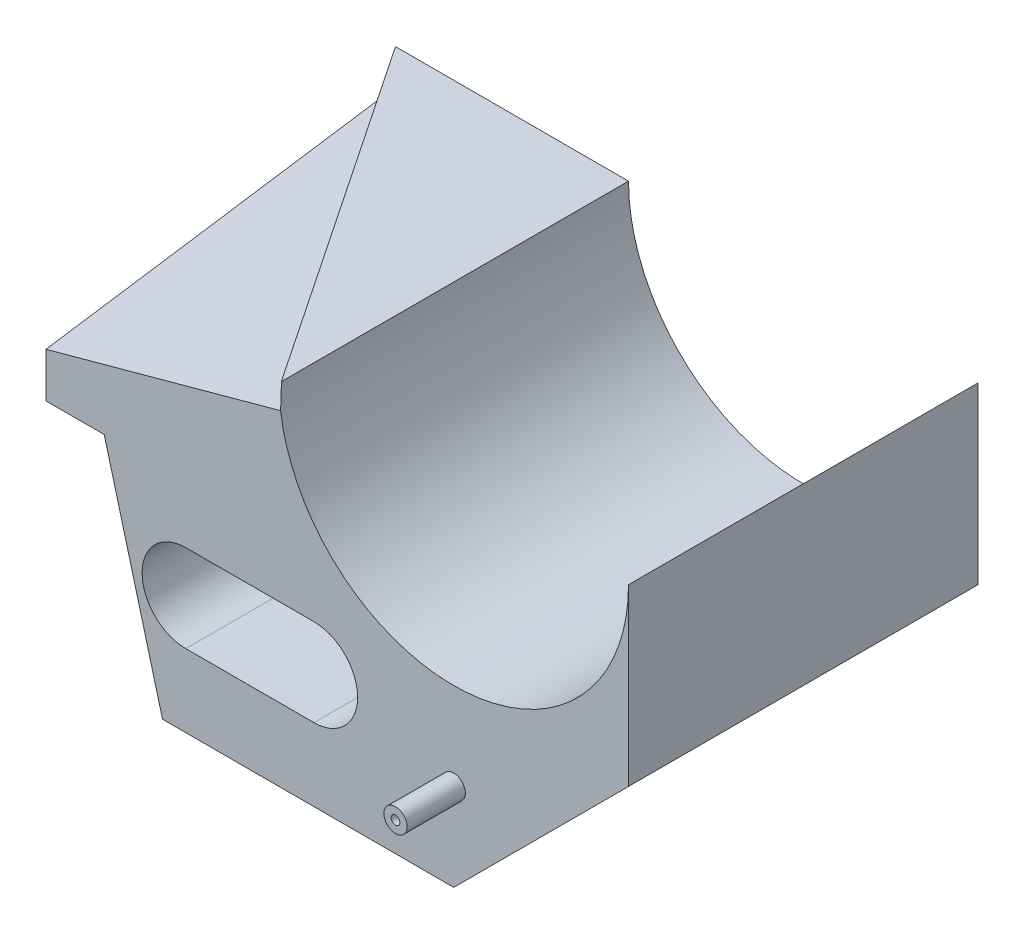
ISO-10303-21;
HEADER;
FILE_DESCRIPTION(('STEP AP214'),'2;1');
FILE_NAME('part.step','',(''),(''),'','','');
FILE_SCHEMA(('AUTOMOTIVE_DESIGN { 1 0 10303 214 1 1 1 1 }'));
ENDSEC;
DATA;
#1=APPLICATION_CONTEXT('core data for automotive mechanical design processes');
#2=APPLICATION_PROTOCOL_DEFINITION('international standard','automotive_design',2000,#1);
#3=PRODUCT_CONTEXT('',#1,'mechanical');
#4=PRODUCT('Part','Part','',(#3));
#5=PRODUCT_RELATED_PRODUCT_CATEGORY('part','',(#4));
#6=PRODUCT_DEFINITION_FORMATION('','',#4);
#7=PRODUCT_DEFINITION_CONTEXT('part definition',#1,'design');
#8=PRODUCT_DEFINITION('design','',#6,#7);
#9=PRODUCT_DEFINITION_SHAPE('','',#8);
#10=(LENGTH_UNIT() NAMED_UNIT(*) SI_UNIT(.MILLI.,.METRE.));
#11=(NAMED_UNIT(*) PLANE_ANGLE_UNIT() SI_UNIT($,.RADIAN.));
#12=(NAMED_UNIT(*) SI_UNIT($,.STERADIAN.) SOLID_ANGLE_UNIT());
#13=UNCERTAINTY_MEASURE_WITH_UNIT(LENGTH_MEASURE(1.E-05),#10,'distance_accuracy_value','');
#14=(GEOMETRIC_REPRESENTATION_CONTEXT(3) GLOBAL_UNCERTAINTY_ASSIGNED_CONTEXT((#13)) GLOBAL_UNIT_ASSIGNED_CONTEXT((#10,
#11,#12)) REPRESENTATION_CONTEXT('',''));
#15=CARTESIAN_POINT('',(0.,0.,0.));
#16=DIRECTION('',(0.,0.,1.));
#17=DIRECTION('',(1.,0.,0.));
#18=AXIS2_PLACEMENT_3D('',#15,#16,#17);
#19=CARTESIAN_POINT('',(-10.,37.3205080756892,30.));
#20=DIRECTION('',(0.965925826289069,0.258819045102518,0.));
#21=DIRECTION('',(-0.258819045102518,0.965925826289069,0.));
#22=AXIS2_PLACEMENT_3D('',#19,#20,#21);
#23=PLANE('',#22);
#24=DIRECTION('',(0.258819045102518,-0.965925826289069,0.));
#25=VECTOR('',#24,1.);
#26=CARTESIAN_POINT('',(-10.,37.3205080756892,-30.));
#27=LINE('',#26,#25);
#28=CARTESIAN_POINT('',(-10.,37.3205080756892,-30.));
#29=VERTEX_POINT('',#28);
#30=CARTESIAN_POINT('',(0.,0.,-30.));
#31=VERTEX_POINT('',#30);
#32=EDGE_CURVE('E171',#29,#31,#27,.T.);
#33=ORIENTED_EDGE('',*,*,#32,.T.);
#34=DIRECTION('',(0.,0.,-1.));
#35=VECTOR('',#34,1.);
#36=CARTESIAN_POINT('',(0.,0.,30.));
#37=LINE('',#36,#35);
#38=CARTESIAN_POINT('',(0.,0.,30.));
#39=VERTEX_POINT('',#38);
#40=EDGE_CURVE('E54',#39,#31,#37,.T.);
#41=ORIENTED_EDGE('',*,*,#40,.F.);
#42=DIRECTION('',(0.258819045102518,-0.965925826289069,0.));
#43=VECTOR('',#42,1.);
#44=CARTESIAN_POINT('',(-10.,37.3205080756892,30.));
#45=LINE('',#44,#43);
#46=CARTESIAN_POINT('',(-10.,37.3205080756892,30.));
#47=VERTEX_POINT('',#46);
#48=EDGE_CURVE('E214',#47,#39,#45,.T.);
#49=ORIENTED_EDGE('',*,*,#48,.F.);
#50=DIRECTION('',(0.,0.,-1.));
#51=VECTOR('',#50,1.);
#52=CARTESIAN_POINT('',(-10.,37.3205080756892,30.));
#53=LINE('',#52,#51);
#54=EDGE_CURVE('E170',#47,#29,#53,.T.);
#55=ORIENTED_EDGE('',*,*,#54,.T.);
#56=EDGE_LOOP('',(#33,#41,#49,#55));
#57=FACE_BOUND('',#56,.T.);
#58=ADVANCED_FACE('F46',(#57),#23,.F.);
#59=CARTESIAN_POINT('',(0.,0.,30.));
#60=DIRECTION('',(0.,1.,0.));
#61=DIRECTION('',(0.,0.,1.));
#62=AXIS2_PLACEMENT_3D('',#59,#60,#61);
#63=PLANE('',#62);
#64=DIRECTION('',(1.,0.,0.));
#65=VECTOR('',#64,1.);
#66=CARTESIAN_POINT('',(0.,0.,-30.));
#67=LINE('',#66,#65);
#68=CARTESIAN_POINT('',(50.,0.,-30.));
#69=VERTEX_POINT('',#68);
#70=EDGE_CURVE('E175',#31,#69,#67,.T.);
#71=ORIENTED_EDGE('',*,*,#70,.T.);
#72=DIRECTION('',(0.,0.,-1.));
#73=VECTOR('',#72,1.);
#74=CARTESIAN_POINT('',(50.,0.,30.));
#75=LINE('',#74,#73);
#76=CARTESIAN_POINT('',(50.,0.,30.));
#77=VERTEX_POINT('',#76);
#78=EDGE_CURVE('E199',#77,#69,#75,.T.);
#79=ORIENTED_EDGE('',*,*,#78,.F.);
#80=DIRECTION('',(1.,0.,0.));
#81=VECTOR('',#80,1.);
#82=CARTESIAN_POINT('',(0.,0.,30.));
#83=LINE('',#82,#81);
#84=EDGE_CURVE('E112',#39,#77,#83,.T.);
#85=ORIENTED_EDGE('',*,*,#84,.F.);
#86=ORIENTED_EDGE('',*,*,#40,.T.);
#87=EDGE_LOOP('',(#71,#79,#85,#86));
#88=FACE_BOUND('',#87,.T.);
#89=ADVANCED_FACE('F219',(#88),#63,.F.);
#90=CARTESIAN_POINT('',(50.,0.,30.));
#91=DIRECTION('',(-0.707106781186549,0.707106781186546,0.));
#92=DIRECTION('',(-0.707106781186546,-0.707106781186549,0.));
#93=AXIS2_PLACEMENT_3D('',#90,#91,#92);
#94=PLANE('',#93);
#95=DIRECTION('',(0.707106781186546,0.707106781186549,0.));
#96=VECTOR('',#95,1.);
#97=CARTESIAN_POINT('',(50.,0.,-30.));
#98=LINE('',#97,#96);
#99=CARTESIAN_POINT('',(80.,30.0000000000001,-30.));
#100=VERTEX_POINT('',#99);
#101=EDGE_CURVE('E179',#69,#100,#98,.T.);
#102=ORIENTED_EDGE('',*,*,#101,.T.);
#103=DIRECTION('',(0.,0.,-1.));
#104=VECTOR('',#103,1.);
#105=CARTESIAN_POINT('',(80.,30.0000000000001,30.));
#106=LINE('',#105,#104);
#107=CARTESIAN_POINT('',(80.,30.0000000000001,30.));
#108=VERTEX_POINT('',#107);
#109=EDGE_CURVE('E146',#108,#100,#106,.T.);
#110=ORIENTED_EDGE('',*,*,#109,.F.);
#111=DIRECTION('',(0.707106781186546,0.707106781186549,0.));
#112=VECTOR('',#111,1.);
#113=CARTESIAN_POINT('',(50.,0.,30.));
#114=LINE('',#113,#112);
#115=EDGE_CURVE('E131',#77,#108,#114,.T.);
#116=ORIENTED_EDGE('',*,*,#115,.F.);
#117=ORIENTED_EDGE('',*,*,#78,.T.);
#118=EDGE_LOOP('',(#102,#110,#116,#117));
#119=FACE_BOUND('',#118,.T.);
#120=ADVANCED_FACE('F221',(#119),#94,.F.);
#121=CARTESIAN_POINT('',(80.,30.0000000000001,30.));
#122=DIRECTION('',(-1.,0.,0.));
#123=DIRECTION('',(0.,-1.,0.));
#124=AXIS2_PLACEMENT_3D('',#121,#122,#123);
#125=PLANE('',#124);
#126=DIRECTION('',(0.,1.,0.));
#127=VECTOR('',#126,1.);
#128=CARTESIAN_POINT('',(80.,30.0000000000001,-30.));
#129=LINE('',#128,#127);
#130=CARTESIAN_POINT('',(80.,60.,-30.));
#131=VERTEX_POINT('',#130);
#132=EDGE_CURVE('E141',#100,#131,#129,.T.);
#133=ORIENTED_EDGE('',*,*,#132,.T.);
#134=DIRECTION('',(0.,0.,-1.));
#135=VECTOR('',#134,1.);
#136=CARTESIAN_POINT('',(80.,60.,30.));
#137=LINE('',#136,#135);
#138=CARTESIAN_POINT('',(80.,60.,30.));
#139=VERTEX_POINT('',#138);
#140=EDGE_CURVE('E138',#139,#131,#137,.T.);
#141=ORIENTED_EDGE('',*,*,#140,.F.);
#142=DIRECTION('',(0.,1.,0.));
#143=VECTOR('',#142,1.);
#144=CARTESIAN_POINT('',(80.,30.0000000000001,30.));
#145=LINE('',#144,#143);
#146=EDGE_CURVE('E123',#108,#139,#145,.T.);
#147=ORIENTED_EDGE('',*,*,#146,.F.);
#148=ORIENTED_EDGE('',*,*,#109,.T.);
#149=EDGE_LOOP('',(#133,#141,#147,#148));
#150=FACE_BOUND('',#149,.T.);
#151=ADVANCED_FACE('F139',(#150),#125,.F.);
#152=CARTESIAN_POINT('',(50.,60.,30.));
#153=DIRECTION('',(0.,0.,-1.));
#154=DIRECTION('',(-1.,0.,0.));
#155=AXIS2_PLACEMENT_3D('',#152,#153,#154);
#156=CYLINDRICAL_SURFACE('',#155,30.);
#157=DIRECTION('',(0.,0.,-1.));
#158=VECTOR('',#157,1.);
#159=CARTESIAN_POINT('',(20.,60.,30.));
#160=LINE('',#159,#158);
#161=CARTESIAN_POINT('',(20.,60.,29.6026490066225));
#162=VERTEX_POINT('',#161);
#163=CARTESIAN_POINT('',(20.,60.,-30.));
#164=VERTEX_POINT('',#163);
#165=EDGE_CURVE('E147',#162,#164,#160,.T.);
#166=ORIENTED_EDGE('',*,*,#165,.F.);
#167=CARTESIAN_POINT('',(50.,60.,74.3046357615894));
#168=DIRECTION('',(0.830343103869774,0.,-0.557252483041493));
#169=DIRECTION('',(-0.557252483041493,0.,-0.830343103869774));
#170=AXIS2_PLACEMENT_3D('',#167,#168,#169);
#171=ELLIPSE('',#170,53.8355609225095,30.);
#172=CARTESIAN_POINT('',(20.2666666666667,56.0088987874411,30.));
#173=VERTEX_POINT('',#172);
#174=EDGE_CURVE('E153',#162,#173,#171,.F.);
#175=ORIENTED_EDGE('',*,*,#174,.T.);
#176=CARTESIAN_POINT('',(50.,60.,30.));
#177=DIRECTION('',(0.,0.,-1.));
#178=DIRECTION('',(-1.,0.,0.));
#179=AXIS2_PLACEMENT_3D('',#176,#177,#178);
#180=CIRCLE('',#179,30.);
#181=EDGE_CURVE('E129',#139,#173,#180,.T.);
#182=ORIENTED_EDGE('',*,*,#181,.F.);
#183=ORIENTED_EDGE('',*,*,#140,.T.);
#184=CARTESIAN_POINT('',(50.,60.,-30.));
#185=DIRECTION('',(0.,0.,-1.));
#186=DIRECTION('',(-1.,0.,0.));
#187=AXIS2_PLACEMENT_3D('',#184,#185,#186);
#188=CIRCLE('',#187,30.);
#189=EDGE_CURVE('E184',#131,#164,#188,.T.);
#190=ORIENTED_EDGE('',*,*,#189,.T.);
#191=EDGE_LOOP('',(#166,#175,#182,#183,#190));
#192=FACE_BOUND('',#191,.T.);
#193=ADVANCED_FACE('F151',(#192),#156,.F.);
#194=CARTESIAN_POINT('',(20.,60.,30.));
#195=DIRECTION('',(0.,-1.,0.));
#196=DIRECTION('',(1.,0.,0.));
#197=AXIS2_PLACEMENT_3D('',#194,#195,#196);
#198=PLANE('',#197);
#199=DIRECTION('',(-1.,0.,0.));
#200=VECTOR('',#199,1.);
#201=CARTESIAN_POINT('',(20.,60.,-30.));
#202=LINE('',#201,#200);
#203=CARTESIAN_POINT('',(-20.,60.,-30.));
#204=VERTEX_POINT('',#203);
#205=EDGE_CURVE('E187',#164,#204,#202,.T.);
#206=ORIENTED_EDGE('',*,*,#205,.T.);
#207=DIRECTION('',(0.557252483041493,0.,0.830343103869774));
#208=VECTOR('',#207,1.);
#209=CARTESIAN_POINT('',(20.1838585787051,60.,29.8766104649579));
#210=LINE('',#209,#208);
#211=EDGE_CURVE('E319',#204,#162,#210,.T.);
#212=ORIENTED_EDGE('',*,*,#211,.T.);
#213=ORIENTED_EDGE('',*,*,#165,.T.);
#214=EDGE_LOOP('',(#206,#212,#213));
#215=FACE_BOUND('',#214,.T.);
#216=ADVANCED_FACE('F233',(#215),#198,.F.);
#217=CARTESIAN_POINT('',(-20.,60.,30.));
#218=DIRECTION('',(1.,0.,0.));
#219=DIRECTION('',(0.,1.,0.));
#220=AXIS2_PLACEMENT_3D('',#217,#218,#219);
#221=PLANE('',#220);
#222=DIRECTION('',(0.,-1.,0.));
#223=VECTOR('',#222,1.);
#224=CARTESIAN_POINT('',(-20.,60.,30.));
#225=LINE('',#224,#223);
#226=CARTESIAN_POINT('',(-20.,45.,30.));
#227=VERTEX_POINT('',#226);
#228=CARTESIAN_POINT('',(-20.,37.3205080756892,30.));
#229=VERTEX_POINT('',#228);
#230=EDGE_CURVE('E155',#227,#229,#225,.T.);
#231=ORIENTED_EDGE('',*,*,#230,.F.);
#232=DIRECTION('',(0.,-0.148340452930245,0.988936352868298));
#233=VECTOR('',#232,1.);
#234=CARTESIAN_POINT('',(-20.,54.,-30.));
#235=LINE('',#234,#233);
#236=CARTESIAN_POINT('',(-20.,54.,-30.));
#237=VERTEX_POINT('',#236);
#238=EDGE_CURVE('E312',#237,#227,#235,.T.);
#239=ORIENTED_EDGE('',*,*,#238,.F.);
#240=DIRECTION('',(0.,-1.,0.));
#241=VECTOR('',#240,1.);
#242=CARTESIAN_POINT('',(-20.,60.,-30.));
#243=LINE('',#242,#241);
#244=CARTESIAN_POINT('',(-20.,37.3205080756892,-30.));
#245=VERTEX_POINT('',#244);
#246=EDGE_CURVE('E190',#237,#245,#243,.T.);
#247=ORIENTED_EDGE('',*,*,#246,.T.);
#248=DIRECTION('',(0.,0.,-1.));
#249=VECTOR('',#248,1.);
#250=CARTESIAN_POINT('',(-20.,37.3205080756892,30.));
#251=LINE('',#250,#249);
#252=EDGE_CURVE('E207',#229,#245,#251,.T.);
#253=ORIENTED_EDGE('',*,*,#252,.F.);
#254=EDGE_LOOP('',(#231,#239,#247,#253));
#255=FACE_BOUND('',#254,.T.);
#256=ADVANCED_FACE('F236',(#255),#221,.F.);
#257=CARTESIAN_POINT('',(-20.,37.3205080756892,30.));
#258=DIRECTION('',(0.,1.,0.));
#259=DIRECTION('',(0.,0.,1.));
#260=AXIS2_PLACEMENT_3D('',#257,#258,#259);
#261=PLANE('',#260);
#262=DIRECTION('',(1.,0.,0.));
#263=VECTOR('',#262,1.);
#264=CARTESIAN_POINT('',(-20.,37.3205080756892,-30.));
#265=LINE('',#264,#263);
#266=EDGE_CURVE('E103',#245,#29,#265,.T.);
#267=ORIENTED_EDGE('',*,*,#266,.T.);
#268=ORIENTED_EDGE('',*,*,#54,.F.);
#269=DIRECTION('',(1.,0.,0.));
#270=VECTOR('',#269,1.);
#271=CARTESIAN_POINT('',(-20.,37.3205080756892,30.));
#272=LINE('',#271,#270);
#273=EDGE_CURVE('E70',#229,#47,#272,.T.);
#274=ORIENTED_EDGE('',*,*,#273,.F.);
#275=ORIENTED_EDGE('',*,*,#252,.T.);
#276=EDGE_LOOP('',(#267,#268,#274,#275));
#277=FACE_BOUND('',#276,.T.);
#278=ADVANCED_FACE('F240',(#277),#261,.F.);
#279=CARTESIAN_POINT('',(50.,60.,30.));
#280=DIRECTION('',(0.,0.,-1.));
#281=DIRECTION('',(-1.,0.,0.));
#282=AXIS2_PLACEMENT_3D('',#279,#280,#281);
#283=PLANE('',#282);
#284=CARTESIAN_POINT('',(50.,15.,30.));
#285=DIRECTION('',(0.,0.,-1.));
#286=DIRECTION('',(-1.,0.,0.));
#287=AXIS2_PLACEMENT_3D('',#284,#285,#286);
#288=CIRCLE('',#287,2.);
#289=CARTESIAN_POINT('',(48.,15.,30.));
#290=VERTEX_POINT('',#289);
#291=EDGE_CURVE('E13',#290,#290,#288,.F.);
#292=ORIENTED_EDGE('',*,*,#291,.F.);
#293=EDGE_LOOP('',(#292));
#294=FACE_BOUND('',#293,.T.);
#295=CARTESIAN_POINT('',(26.,20.,30.));
#296=DIRECTION('',(0.,0.,1.));
#297=DIRECTION('',(1.,0.,0.));
#298=AXIS2_PLACEMENT_3D('',#295,#296,#297);
#299=CIRCLE('',#298,7.5);
#300=CARTESIAN_POINT('',(26.,12.5,30.));
#301=VERTEX_POINT('',#300);
#302=CARTESIAN_POINT('',(26.,27.5,30.));
#303=VERTEX_POINT('',#302);
#304=EDGE_CURVE('E338',#301,#303,#299,.T.);
#305=ORIENTED_EDGE('',*,*,#304,.F.);
#306=DIRECTION('',(1.,0.,0.));
#307=VECTOR('',#306,1.);
#308=CARTESIAN_POINT('',(4.,12.5,30.));
#309=LINE('',#308,#307);
#310=CARTESIAN_POINT('',(4.,12.5,30.));
#311=VERTEX_POINT('',#310);
#312=EDGE_CURVE('E342',#311,#301,#309,.T.);
#313=ORIENTED_EDGE('',*,*,#312,.F.);
#314=CARTESIAN_POINT('',(4.,20.,30.));
#315=DIRECTION('',(0.,0.,1.));
#316=DIRECTION('',(1.,0.,0.));
#317=AXIS2_PLACEMENT_3D('',#314,#315,#316);
#318=CIRCLE('',#317,7.5);
#319=CARTESIAN_POINT('',(4.,27.5,30.));
#320=VERTEX_POINT('',#319);
#321=EDGE_CURVE('E332',#320,#311,#318,.T.);
#322=ORIENTED_EDGE('',*,*,#321,.F.);
#323=DIRECTION('',(-1.,0.,0.));
#324=VECTOR('',#323,1.);
#325=CARTESIAN_POINT('',(4.,27.5,30.));
#326=LINE('',#325,#324);
#327=EDGE_CURVE('E61',#303,#320,#326,.T.);
#328=ORIENTED_EDGE('',*,*,#327,.F.);
#329=EDGE_LOOP('',(#305,#313,#322,#328));
#330=FACE_BOUND('',#329,.T.);
#331=ORIENTED_EDGE('',*,*,#181,.T.);
#332=DIRECTION('',(0.96459895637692,0.263721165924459,0.));
#333=VECTOR('',#332,1.);
#334=CARTESIAN_POINT('',(-20.,45.,30.));
#335=LINE('',#334,#333);
#336=EDGE_CURVE('E308',#227,#173,#335,.T.);
#337=ORIENTED_EDGE('',*,*,#336,.F.);
#338=ORIENTED_EDGE('',*,*,#230,.T.);
#339=ORIENTED_EDGE('',*,*,#273,.T.);
#340=ORIENTED_EDGE('',*,*,#48,.T.);
#341=ORIENTED_EDGE('',*,*,#84,.T.);
#342=ORIENTED_EDGE('',*,*,#115,.T.);
#343=ORIENTED_EDGE('',*,*,#146,.T.);
#344=EDGE_LOOP('',(#331,#337,#338,#339,#340,#341,#342,#343));
#345=FACE_BOUND('',#344,.T.);
#346=ADVANCED_FACE('F125',(#294,#330,#345),#283,.F.);
#347=CARTESIAN_POINT('',(50.,60.,-30.));
#348=DIRECTION('',(0.,0.,-1.));
#349=DIRECTION('',(-1.,0.,0.));
#350=AXIS2_PLACEMENT_3D('',#347,#348,#349);
#351=PLANE('',#350);
#352=ORIENTED_EDGE('',*,*,#32,.F.);
#353=ORIENTED_EDGE('',*,*,#266,.F.);
#354=ORIENTED_EDGE('',*,*,#246,.F.);
#355=EDGE_CURVE('E160',#204,#237,#243,.T.);
#356=ORIENTED_EDGE('',*,*,#355,.F.);
#357=ORIENTED_EDGE('',*,*,#205,.F.);
#358=ORIENTED_EDGE('',*,*,#189,.F.);
#359=ORIENTED_EDGE('',*,*,#132,.F.);
#360=ORIENTED_EDGE('',*,*,#101,.F.);
#361=ORIENTED_EDGE('',*,*,#70,.F.);
#362=EDGE_LOOP('',(#352,#353,#354,#356,#357,#358,#359,#360,#361));
#363=FACE_BOUND('',#362,.T.);
#364=ADVANCED_FACE('F216',(#363),#351,.T.);
#365=CARTESIAN_POINT('',(50.,60.,-10.));
#366=DIRECTION('',(0.,0.,-1.));
#367=DIRECTION('',(-1.,0.,0.));
#368=AXIS2_PLACEMENT_3D('',#365,#366,#367);
#369=PLANE('',#368);
#370=CARTESIAN_POINT('',(4.,20.,-10.));
#371=DIRECTION('',(0.,0.,-1.));
#372=DIRECTION('',(-1.,0.,0.));
#373=AXIS2_PLACEMENT_3D('',#370,#371,#372);
#374=CIRCLE('',#373,7.5);
#375=CARTESIAN_POINT('',(4.,27.5,-10.));
#376=VERTEX_POINT('',#375);
#377=CARTESIAN_POINT('',(4.,12.5,-10.));
#378=VERTEX_POINT('',#377);
#379=EDGE_CURVE('E353',#376,#378,#374,.F.);
#380=ORIENTED_EDGE('',*,*,#379,.T.);
#381=DIRECTION('',(1.,0.,0.));
#382=VECTOR('',#381,1.);
#383=CARTESIAN_POINT('',(4.,12.5,-10.));
#384=LINE('',#383,#382);
#385=CARTESIAN_POINT('',(26.,12.5,-10.));
#386=VERTEX_POINT('',#385);
#387=EDGE_CURVE('E337',#378,#386,#384,.T.);
#388=ORIENTED_EDGE('',*,*,#387,.T.);
#389=CARTESIAN_POINT('',(26.,20.,-10.));
#390=DIRECTION('',(0.,0.,-1.));
#391=DIRECTION('',(-1.,0.,0.));
#392=AXIS2_PLACEMENT_3D('',#389,#390,#391);
#393=CIRCLE('',#392,7.5);
#394=CARTESIAN_POINT('',(26.,27.5,-10.));
#395=VERTEX_POINT('',#394);
#396=EDGE_CURVE('E363',#386,#395,#393,.F.);
#397=ORIENTED_EDGE('',*,*,#396,.T.);
#398=DIRECTION('',(-1.,0.,0.));
#399=VECTOR('',#398,1.);
#400=CARTESIAN_POINT('',(4.,27.5,-10.));
#401=LINE('',#400,#399);
#402=EDGE_CURVE('E358',#395,#376,#401,.T.);
#403=ORIENTED_EDGE('',*,*,#402,.T.);
#404=EDGE_LOOP('',(#380,#388,#397,#403));
#405=FACE_BOUND('',#404,.T.);
#406=ADVANCED_FACE('F246',(#405),#369,.F.);
#407=CARTESIAN_POINT('',(4.,12.5,-69.9249295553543));
#408=DIRECTION('',(0.,-1.,0.));
#409=DIRECTION('',(1.,0.,0.));
#410=AXIS2_PLACEMENT_3D('',#407,#408,#409);
#411=PLANE('',#410);
#412=DIRECTION('',(0.,0.,1.));
#413=VECTOR('',#412,1.);
#414=CARTESIAN_POINT('',(4.,12.5,-69.9249295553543));
#415=LINE('',#414,#413);
#416=EDGE_CURVE('E176',#378,#311,#415,.T.);
#417=ORIENTED_EDGE('',*,*,#416,.T.);
#418=ORIENTED_EDGE('',*,*,#312,.T.);
#419=DIRECTION('',(0.,0.,1.));
#420=VECTOR('',#419,1.);
#421=CARTESIAN_POINT('',(26.,12.5,-69.9249295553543));
#422=LINE('',#421,#420);
#423=EDGE_CURVE('E352',#386,#301,#422,.T.);
#424=ORIENTED_EDGE('',*,*,#423,.F.);
#425=ORIENTED_EDGE('',*,*,#387,.F.);
#426=EDGE_LOOP('',(#417,#418,#424,#425));
#427=FACE_BOUND('',#426,.T.);
#428=ADVANCED_FACE('F253',(#427),#411,.F.);
#429=CARTESIAN_POINT('',(26.,20.,-69.9249295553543));
#430=DIRECTION('',(0.,0.,1.));
#431=DIRECTION('',(1.,0.,0.));
#432=AXIS2_PLACEMENT_3D('',#429,#430,#431);
#433=CYLINDRICAL_SURFACE('',#432,7.5);
#434=ORIENTED_EDGE('',*,*,#423,.T.);
#435=ORIENTED_EDGE('',*,*,#304,.T.);
#436=DIRECTION('',(0.,0.,1.));
#437=VECTOR('',#436,1.);
#438=CARTESIAN_POINT('',(26.,27.5,-69.9249295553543));
#439=LINE('',#438,#437);
#440=EDGE_CURVE('E362',#395,#303,#439,.T.);
#441=ORIENTED_EDGE('',*,*,#440,.F.);
#442=ORIENTED_EDGE('',*,*,#396,.F.);
#443=EDGE_LOOP('',(#434,#435,#441,#442));
#444=FACE_BOUND('',#443,.T.);
#445=ADVANCED_FACE('F257',(#444),#433,.F.);
#446=CARTESIAN_POINT('',(4.,27.5,-69.9249295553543));
#447=DIRECTION('',(0.,1.,0.));
#448=DIRECTION('',(-1.,0.,0.));
#449=AXIS2_PLACEMENT_3D('',#446,#447,#448);
#450=PLANE('',#449);
#451=ORIENTED_EDGE('',*,*,#440,.T.);
#452=ORIENTED_EDGE('',*,*,#327,.T.);
#453=DIRECTION('',(0.,0.,1.));
#454=VECTOR('',#453,1.);
#455=CARTESIAN_POINT('',(4.,27.5,-69.9249295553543));
#456=LINE('',#455,#454);
#457=EDGE_CURVE('E357',#376,#320,#456,.T.);
#458=ORIENTED_EDGE('',*,*,#457,.F.);
#459=ORIENTED_EDGE('',*,*,#402,.F.);
#460=EDGE_LOOP('',(#451,#452,#458,#459));
#461=FACE_BOUND('',#460,.T.);
#462=ADVANCED_FACE('F261',(#461),#450,.F.);
#463=CARTESIAN_POINT('',(4.,20.,-69.9249295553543));
#464=DIRECTION('',(0.,0.,1.));
#465=DIRECTION('',(1.,0.,0.));
#466=AXIS2_PLACEMENT_3D('',#463,#464,#465);
#467=CYLINDRICAL_SURFACE('',#466,7.5);
#468=ORIENTED_EDGE('',*,*,#457,.T.);
#469=ORIENTED_EDGE('',*,*,#321,.T.);
#470=ORIENTED_EDGE('',*,*,#416,.F.);
#471=ORIENTED_EDGE('',*,*,#379,.F.);
#472=EDGE_LOOP('',(#468,#469,#470,#471));
#473=FACE_BOUND('',#472,.T.);
#474=ADVANCED_FACE('F265',(#473),#467,.F.);
#475=CARTESIAN_POINT('',(20.2666666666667,56.0088987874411,30.));
#476=DIRECTION('',(0.830343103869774,0.,-0.557252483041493));
#477=DIRECTION('',(-0.557252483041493,0.,-0.830343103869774));
#478=AXIS2_PLACEMENT_3D('',#475,#476,#477);
#479=PLANE('',#478);
#480=ORIENTED_EDGE('',*,*,#211,.F.);
#481=ORIENTED_EDGE('',*,*,#355,.T.);
#482=DIRECTION('',(-0.557037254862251,-0.0277905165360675,-0.830022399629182));
#483=VECTOR('',#482,1.);
#484=CARTESIAN_POINT('',(20.2666666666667,56.0088987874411,30.));
#485=LINE('',#484,#483);
#486=EDGE_CURVE('E315',#173,#237,#485,.T.);
#487=ORIENTED_EDGE('',*,*,#486,.F.);
#488=ORIENTED_EDGE('',*,*,#174,.F.);
#489=EDGE_LOOP('',(#480,#481,#487,#488));
#490=FACE_BOUND('',#489,.T.);
#491=ADVANCED_FACE('F268',(#490),#479,.F.);
#492=CARTESIAN_POINT('',(-13.6963082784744,50.0962621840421,7.51443932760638));
#493=DIRECTION('',(0.261003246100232,-0.954657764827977,-0.143198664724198));
#494=DIRECTION('',(0.96459895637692,0.26372116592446,0.));
#495=AXIS2_PLACEMENT_3D('',#492,#493,#494);
#496=PLANE('',#495);
#497=ORIENTED_EDGE('',*,*,#486,.T.);
#498=ORIENTED_EDGE('',*,*,#238,.T.);
#499=ORIENTED_EDGE('',*,*,#336,.T.);
#500=EDGE_LOOP('',(#497,#498,#499));
#501=FACE_BOUND('',#500,.T.);
#502=ADVANCED_FACE('F270',(#501),#496,.F.);
#503=CARTESIAN_POINT('',(50.,15.,40.));
#504=DIRECTION('',(0.,0.,1.));
#505=DIRECTION('',(1.,0.,0.));
#506=AXIS2_PLACEMENT_3D('',#503,#504,#505);
#507=PLANE('',#506);
#508=CARTESIAN_POINT('',(50.,15.,40.));
#509=DIRECTION('',(0.,0.,1.));
#510=DIRECTION('',(1.,0.,0.));
#511=AXIS2_PLACEMENT_3D('',#508,#509,#510);
#512=CIRCLE('',#511,2.);
#513=CARTESIAN_POINT('',(52.,15.,40.));
#514=VERTEX_POINT('',#513);
#515=EDGE_CURVE('E302',#514,#514,#512,.T.);
#516=ORIENTED_EDGE('',*,*,#515,.T.);
#517=EDGE_LOOP('',(#516));
#518=FACE_BOUND('',#517,.T.);
#519=CARTESIAN_POINT('',(50.,15.,40.));
#520=DIRECTION('',(0.,0.,1.));
#521=DIRECTION('',(1.,0.,0.));
#522=AXIS2_PLACEMENT_3D('',#519,#520,#521);
#523=CIRCLE('',#522,0.749999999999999);
#524=CARTESIAN_POINT('',(50.75,15.,40.));
#525=VERTEX_POINT('',#524);
#526=EDGE_CURVE('E295',#525,#525,#523,.T.);
#527=ORIENTED_EDGE('',*,*,#526,.F.);
#528=EDGE_LOOP('',(#527));
#529=FACE_BOUND('',#528,.T.);
#530=ADVANCED_FACE('F273',(#518,#529),#507,.T.);
#531=CARTESIAN_POINT('',(50.,15.,40.));
#532=DIRECTION('',(0.,0.,-1.));
#533=DIRECTION('',(-1.,0.,0.));
#534=AXIS2_PLACEMENT_3D('',#531,#532,#533);
#535=CYLINDRICAL_SURFACE('',#534,2.);
#536=ORIENTED_EDGE('',*,*,#515,.F.);
#537=EDGE_LOOP('',(#536));
#538=FACE_BOUND('',#537,.T.);
#539=ORIENTED_EDGE('',*,*,#291,.T.);
#540=EDGE_LOOP('',(#539));
#541=FACE_BOUND('',#540,.T.);
#542=ADVANCED_FACE('F278',(#538,#541),#535,.T.);
#543=CARTESIAN_POINT('',(50.,15.,40.));
#544=DIRECTION('',(0.,0.,-1.));
#545=DIRECTION('',(-1.,0.,0.));
#546=AXIS2_PLACEMENT_3D('',#543,#544,#545);
#547=CYLINDRICAL_SURFACE('',#546,0.749999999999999);
#548=ORIENTED_EDGE('',*,*,#526,.T.);
#549=EDGE_LOOP('',(#548));
#550=FACE_BOUND('',#549,.T.);
#551=CARTESIAN_POINT('',(50.,15.,30.));
#552=DIRECTION('',(0.,0.,1.));
#553=DIRECTION('',(1.,0.,0.));
#554=AXIS2_PLACEMENT_3D('',#551,#552,#553);
#555=CIRCLE('',#554,0.749999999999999);
#556=CARTESIAN_POINT('',(50.75,15.,30.));
#557=VERTEX_POINT('',#556);
#558=EDGE_CURVE('E298',#557,#557,#555,.T.);
#559=ORIENTED_EDGE('',*,*,#558,.F.);
#560=EDGE_LOOP('',(#559));
#561=FACE_BOUND('',#560,.T.);
#562=ADVANCED_FACE('F281',(#550,#561),#547,.F.);
#563=ORIENTED_EDGE('',*,*,#558,.T.);
#564=EDGE_LOOP('',(#563));
#565=FACE_BOUND('',#564,.T.);
#566=ADVANCED_FACE('F250',(#565),#283,.F.);
#567=CLOSED_SHELL('',(#58,#89,#120,#151,#193,#216,#256,#278,#346,#364,#406,#428,#445,#462,#474,
#491,#502,#530,#542,#562,#566));
#568=MANIFOLD_SOLID_BREP('B2',#567);
#569=ADVANCED_BREP_SHAPE_REPRESENTATION('',(#18,#568),#14);
#570=SHAPE_DEFINITION_REPRESENTATION(#9,#569);
ENDSEC;
END-ISO-10303-21;
